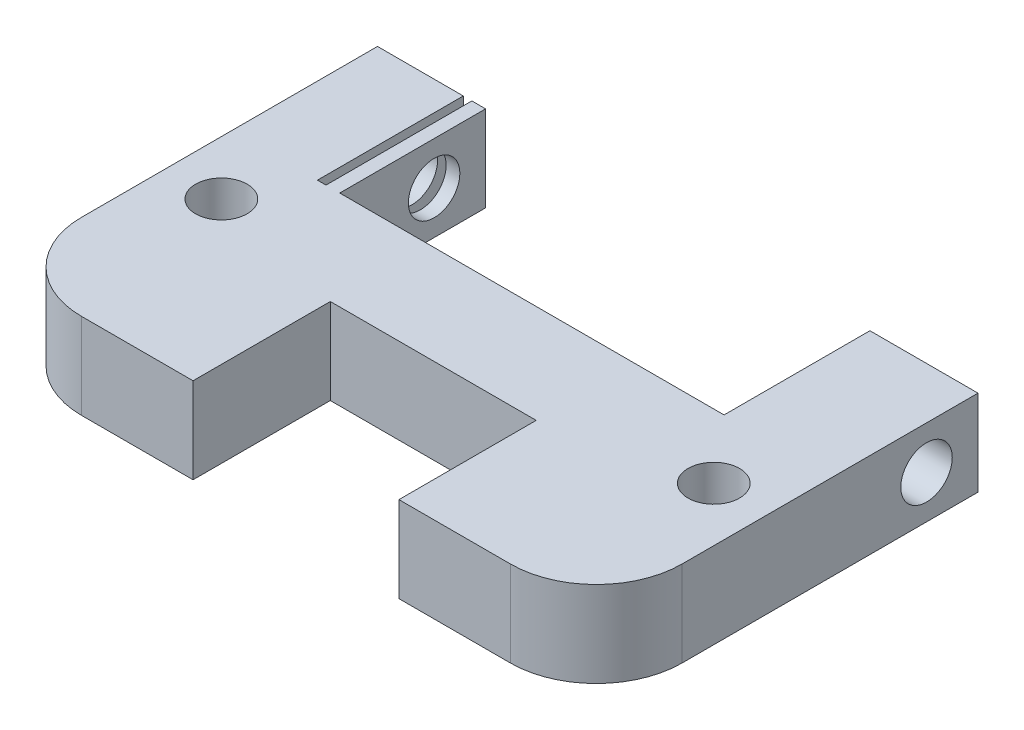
ISO-10303-21;
HEADER;
FILE_DESCRIPTION(('STEP AP214'),'2;1');
FILE_NAME('part.step','',(''),(''),'','','');
FILE_SCHEMA(('AUTOMOTIVE_DESIGN { 1 0 10303 214 1 1 1 1 }'));
ENDSEC;
DATA;
#1=APPLICATION_CONTEXT('core data for automotive mechanical design processes');
#2=APPLICATION_PROTOCOL_DEFINITION('international standard','automotive_design',2000,#1);
#3=PRODUCT_CONTEXT('',#1,'mechanical');
#4=PRODUCT('Part','Part','',(#3));
#5=PRODUCT_RELATED_PRODUCT_CATEGORY('part','',(#4));
#6=PRODUCT_DEFINITION_FORMATION('','',#4);
#7=PRODUCT_DEFINITION_CONTEXT('part definition',#1,'design');
#8=PRODUCT_DEFINITION('design','',#6,#7);
#9=PRODUCT_DEFINITION_SHAPE('','',#8);
#10=(LENGTH_UNIT() NAMED_UNIT(*) SI_UNIT(.MILLI.,.METRE.));
#11=(NAMED_UNIT(*) PLANE_ANGLE_UNIT() SI_UNIT($,.RADIAN.));
#12=(NAMED_UNIT(*) SI_UNIT($,.STERADIAN.) SOLID_ANGLE_UNIT());
#13=UNCERTAINTY_MEASURE_WITH_UNIT(LENGTH_MEASURE(1.E-05),#10,'distance_accuracy_value','');
#14=(GEOMETRIC_REPRESENTATION_CONTEXT(3) GLOBAL_UNCERTAINTY_ASSIGNED_CONTEXT((#13)) GLOBAL_UNIT_ASSIGNED_CONTEXT((#10,
#11,#12)) REPRESENTATION_CONTEXT('',''));
#15=CARTESIAN_POINT('',(0.,0.,0.));
#16=DIRECTION('',(0.,0.,1.));
#17=DIRECTION('',(1.,0.,0.));
#18=AXIS2_PLACEMENT_3D('',#15,#16,#17);
#19=CARTESIAN_POINT('',(0.,5.,0.));
#20=DIRECTION('',(0.,1.,0.));
#21=DIRECTION('',(0.,0.,1.));
#22=AXIS2_PLACEMENT_3D('',#19,#20,#21);
#23=PLANE('',#22);
#24=CARTESIAN_POINT('',(14.35,5.,12.25));
#25=DIRECTION('',(0.,1.,0.));
#26=DIRECTION('',(0.,0.,1.));
#27=AXIS2_PLACEMENT_3D('',#24,#25,#26);
#28=CIRCLE('',#27,1.5);
#29=CARTESIAN_POINT('',(14.35,5.,13.75));
#30=VERTEX_POINT('',#29);
#31=EDGE_CURVE('E211',#30,#30,#28,.T.);
#32=ORIENTED_EDGE('',*,*,#31,.F.);
#33=EDGE_LOOP('',(#32));
#34=FACE_BOUND('',#33,.T.);
#35=DIRECTION('',(1.,0.,0.));
#36=VECTOR('',#35,1.);
#37=CARTESIAN_POINT('',(6.00000000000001,5.,22.25));
#38=LINE('',#37,#36);
#39=CARTESIAN_POINT('',(6.00000000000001,5.,22.25));
#40=VERTEX_POINT('',#39);
#41=CARTESIAN_POINT('',(12.5,5.,22.25));
#42=VERTEX_POINT('',#41);
#43=EDGE_CURVE('E186',#40,#42,#38,.T.);
#44=ORIENTED_EDGE('',*,*,#43,.T.);
#45=CARTESIAN_POINT('',(12.5,5.,17.25));
#46=DIRECTION('',(0.,1.,0.));
#47=DIRECTION('',(0.,0.,1.));
#48=AXIS2_PLACEMENT_3D('',#45,#46,#47);
#49=CIRCLE('',#48,5.);
#50=CARTESIAN_POINT('',(17.5,5.,17.25));
#51=VERTEX_POINT('',#50);
#52=EDGE_CURVE('E292',#42,#51,#49,.T.);
#53=ORIENTED_EDGE('',*,*,#52,.T.);
#54=DIRECTION('',(0.,0.,-1.));
#55=VECTOR('',#54,1.);
#56=CARTESIAN_POINT('',(17.5,5.,0.));
#57=LINE('',#56,#55);
#58=CARTESIAN_POINT('',(17.5,5.,0.));
#59=VERTEX_POINT('',#58);
#60=EDGE_CURVE('E188',#51,#59,#57,.T.);
#61=ORIENTED_EDGE('',*,*,#60,.T.);
#62=DIRECTION('',(-1.,0.,0.));
#63=VECTOR('',#62,1.);
#64=CARTESIAN_POINT('',(11.2,5.,0.));
#65=LINE('',#64,#63);
#66=CARTESIAN_POINT('',(11.2,5.,0.));
#67=VERTEX_POINT('',#66);
#68=EDGE_CURVE('E190',#59,#67,#65,.T.);
#69=ORIENTED_EDGE('',*,*,#68,.T.);
#70=DIRECTION('',(0.,0.,1.));
#71=VECTOR('',#70,1.);
#72=CARTESIAN_POINT('',(11.2,5.,0.));
#73=LINE('',#72,#71);
#74=CARTESIAN_POINT('',(11.2,5.,8.5));
#75=VERTEX_POINT('',#74);
#76=EDGE_CURVE('E192',#67,#75,#73,.T.);
#77=ORIENTED_EDGE('',*,*,#76,.T.);
#78=DIRECTION('',(-1.,0.,0.));
#79=VECTOR('',#78,1.);
#80=CARTESIAN_POINT('',(-11.2,5.,8.50000000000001));
#81=LINE('',#80,#79);
#82=CARTESIAN_POINT('',(-11.2,5.,8.50000000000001));
#83=VERTEX_POINT('',#82);
#84=EDGE_CURVE('E194',#75,#83,#81,.T.);
#85=ORIENTED_EDGE('',*,*,#84,.T.);
#86=DIRECTION('',(0.,0.,-1.));
#87=VECTOR('',#86,1.);
#88=CARTESIAN_POINT('',(-11.2,5.,0.));
#89=LINE('',#88,#87);
#90=CARTESIAN_POINT('',(-11.2,5.,0.));
#91=VERTEX_POINT('',#90);
#92=EDGE_CURVE('E196',#83,#91,#89,.T.);
#93=ORIENTED_EDGE('',*,*,#92,.T.);
#94=DIRECTION('',(-1.,0.,0.));
#95=VECTOR('',#94,1.);
#96=CARTESIAN_POINT('',(-12.,5.,0.));
#97=LINE('',#96,#95);
#98=CARTESIAN_POINT('',(-12.,5.,0.));
#99=VERTEX_POINT('',#98);
#100=EDGE_CURVE('E198',#91,#99,#97,.T.);
#101=ORIENTED_EDGE('',*,*,#100,.T.);
#102=DIRECTION('',(0.,0.,1.));
#103=VECTOR('',#102,1.);
#104=CARTESIAN_POINT('',(-12.,5.,0.));
#105=LINE('',#104,#103);
#106=CARTESIAN_POINT('',(-12.,5.,8.50000000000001));
#107=VERTEX_POINT('',#106);
#108=EDGE_CURVE('E200',#99,#107,#105,.T.);
#109=ORIENTED_EDGE('',*,*,#108,.T.);
#110=DIRECTION('',(-1.,0.,0.));
#111=VECTOR('',#110,1.);
#112=CARTESIAN_POINT('',(-12.,5.,8.50000000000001));
#113=LINE('',#112,#111);
#114=CARTESIAN_POINT('',(-12.5,5.,8.50000000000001));
#115=VERTEX_POINT('',#114);
#116=EDGE_CURVE('E202',#107,#115,#113,.T.);
#117=ORIENTED_EDGE('',*,*,#116,.T.);
#118=DIRECTION('',(0.,0.,-1.));
#119=VECTOR('',#118,1.);
#120=CARTESIAN_POINT('',(-12.5,5.,8.50000000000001));
#121=LINE('',#120,#119);
#122=CARTESIAN_POINT('',(-12.5,5.,0.));
#123=VERTEX_POINT('',#122);
#124=EDGE_CURVE('E204',#115,#123,#121,.T.);
#125=ORIENTED_EDGE('',*,*,#124,.T.);
#126=DIRECTION('',(-1.,0.,0.));
#127=VECTOR('',#126,1.);
#128=CARTESIAN_POINT('',(-17.5,5.,0.));
#129=LINE('',#128,#127);
#130=CARTESIAN_POINT('',(-17.5,5.,0.));
#131=VERTEX_POINT('',#130);
#132=EDGE_CURVE('E206',#123,#131,#129,.T.);
#133=ORIENTED_EDGE('',*,*,#132,.T.);
#134=DIRECTION('',(0.,0.,1.));
#135=VECTOR('',#134,1.);
#136=CARTESIAN_POINT('',(-17.5,5.,0.));
#137=LINE('',#136,#135);
#138=CARTESIAN_POINT('',(-17.5,5.,17.25));
#139=VERTEX_POINT('',#138);
#140=EDGE_CURVE('E164',#131,#139,#137,.T.);
#141=ORIENTED_EDGE('',*,*,#140,.T.);
#142=CARTESIAN_POINT('',(-12.5,5.,17.25));
#143=DIRECTION('',(0.,1.,0.));
#144=DIRECTION('',(0.,0.,1.));
#145=AXIS2_PLACEMENT_3D('',#142,#143,#144);
#146=CIRCLE('',#145,5.);
#147=CARTESIAN_POINT('',(-12.5,5.,22.25));
#148=VERTEX_POINT('',#147);
#149=EDGE_CURVE('E47',#139,#148,#146,.T.);
#150=ORIENTED_EDGE('',*,*,#149,.T.);
#151=DIRECTION('',(1.,0.,0.));
#152=VECTOR('',#151,1.);
#153=CARTESIAN_POINT('',(-17.5,5.,22.25));
#154=LINE('',#153,#152);
#155=CARTESIAN_POINT('',(-5.99999999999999,5.,22.25));
#156=VERTEX_POINT('',#155);
#157=EDGE_CURVE('E154',#148,#156,#154,.T.);
#158=ORIENTED_EDGE('',*,*,#157,.T.);
#159=DIRECTION('',(0.,0.,-1.));
#160=VECTOR('',#159,1.);
#161=CARTESIAN_POINT('',(-5.99999999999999,5.,22.25));
#162=LINE('',#161,#160);
#163=CARTESIAN_POINT('',(-5.99999999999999,5.,14.25));
#164=VERTEX_POINT('',#163);
#165=EDGE_CURVE('E159',#156,#164,#162,.T.);
#166=ORIENTED_EDGE('',*,*,#165,.T.);
#167=DIRECTION('',(1.,0.,0.));
#168=VECTOR('',#167,1.);
#169=CARTESIAN_POINT('',(-5.99999999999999,5.,14.25));
#170=LINE('',#169,#168);
#171=CARTESIAN_POINT('',(6.00000000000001,5.,14.25));
#172=VERTEX_POINT('',#171);
#173=EDGE_CURVE('E179',#164,#172,#170,.T.);
#174=ORIENTED_EDGE('',*,*,#173,.T.);
#175=DIRECTION('',(0.,0.,1.));
#176=VECTOR('',#175,1.);
#177=CARTESIAN_POINT('',(6.00000000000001,5.,22.25));
#178=LINE('',#177,#176);
#179=EDGE_CURVE('E181',#172,#40,#178,.T.);
#180=ORIENTED_EDGE('',*,*,#179,.T.);
#181=EDGE_LOOP('',(#44,#53,#61,#69,#77,#85,#93,#101,#109,#117,#125,#133,#141,#150,#158,#166,
#174,#180));
#182=FACE_BOUND('',#181,.T.);
#183=CARTESIAN_POINT('',(-14.35,5.,12.25));
#184=DIRECTION('',(0.,1.,0.));
#185=DIRECTION('',(0.,0.,-1.));
#186=AXIS2_PLACEMENT_3D('',#183,#184,#185);
#187=CIRCLE('',#186,1.5);
#188=CARTESIAN_POINT('',(-14.35,5.,10.75));
#189=VERTEX_POINT('',#188);
#190=EDGE_CURVE('E371',#189,#189,#187,.T.);
#191=ORIENTED_EDGE('',*,*,#190,.F.);
#192=EDGE_LOOP('',(#191));
#193=FACE_BOUND('',#192,.T.);
#194=ADVANCED_FACE('F32',(#34,#182,#193),#23,.T.);
#195=CARTESIAN_POINT('',(0.,0.,0.));
#196=DIRECTION('',(0.,1.,0.));
#197=DIRECTION('',(0.,0.,1.));
#198=AXIS2_PLACEMENT_3D('',#195,#196,#197);
#199=PLANE('',#198);
#200=CARTESIAN_POINT('',(14.35,0.,12.25));
#201=DIRECTION('',(0.,1.,0.));
#202=DIRECTION('',(0.,0.,1.));
#203=AXIS2_PLACEMENT_3D('',#200,#201,#202);
#204=CIRCLE('',#203,1.5);
#205=CARTESIAN_POINT('',(14.35,0.,13.75));
#206=VERTEX_POINT('',#205);
#207=EDGE_CURVE('E368',#206,#206,#204,.T.);
#208=ORIENTED_EDGE('',*,*,#207,.T.);
#209=EDGE_LOOP('',(#208));
#210=FACE_BOUND('',#209,.T.);
#211=DIRECTION('',(0.,0.,-1.));
#212=VECTOR('',#211,1.);
#213=CARTESIAN_POINT('',(17.5,0.,0.));
#214=LINE('',#213,#212);
#215=CARTESIAN_POINT('',(17.5,0.,17.25));
#216=VERTEX_POINT('',#215);
#217=CARTESIAN_POINT('',(17.5,0.,0.));
#218=VERTEX_POINT('',#217);
#219=EDGE_CURVE('E222',#216,#218,#214,.T.);
#220=ORIENTED_EDGE('',*,*,#219,.F.);
#221=CARTESIAN_POINT('',(12.5,0.,17.25));
#222=DIRECTION('',(0.,1.,0.));
#223=DIRECTION('',(0.,0.,1.));
#224=AXIS2_PLACEMENT_3D('',#221,#222,#223);
#225=CIRCLE('',#224,5.);
#226=CARTESIAN_POINT('',(12.5,0.,22.25));
#227=VERTEX_POINT('',#226);
#228=EDGE_CURVE('E287',#216,#227,#225,.F.);
#229=ORIENTED_EDGE('',*,*,#228,.T.);
#230=DIRECTION('',(1.,0.,0.));
#231=VECTOR('',#230,1.);
#232=CARTESIAN_POINT('',(6.00000000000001,0.,22.25));
#233=LINE('',#232,#231);
#234=CARTESIAN_POINT('',(6.00000000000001,0.,22.25));
#235=VERTEX_POINT('',#234);
#236=EDGE_CURVE('E219',#235,#227,#233,.T.);
#237=ORIENTED_EDGE('',*,*,#236,.F.);
#238=DIRECTION('',(0.,0.,1.));
#239=VECTOR('',#238,1.);
#240=CARTESIAN_POINT('',(6.00000000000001,0.,22.25));
#241=LINE('',#240,#239);
#242=CARTESIAN_POINT('',(6.00000000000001,0.,14.25));
#243=VERTEX_POINT('',#242);
#244=EDGE_CURVE('E217',#243,#235,#241,.T.);
#245=ORIENTED_EDGE('',*,*,#244,.F.);
#246=DIRECTION('',(1.,0.,0.));
#247=VECTOR('',#246,1.);
#248=CARTESIAN_POINT('',(-5.99999999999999,0.,14.25));
#249=LINE('',#248,#247);
#250=CARTESIAN_POINT('',(-5.99999999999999,0.,14.25));
#251=VERTEX_POINT('',#250);
#252=EDGE_CURVE('E215',#251,#243,#249,.T.);
#253=ORIENTED_EDGE('',*,*,#252,.F.);
#254=DIRECTION('',(0.,0.,-1.));
#255=VECTOR('',#254,1.);
#256=CARTESIAN_POINT('',(-5.99999999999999,0.,22.25));
#257=LINE('',#256,#255);
#258=CARTESIAN_POINT('',(-5.99999999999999,0.,22.25));
#259=VERTEX_POINT('',#258);
#260=EDGE_CURVE('E213',#259,#251,#257,.T.);
#261=ORIENTED_EDGE('',*,*,#260,.F.);
#262=DIRECTION('',(1.,0.,0.));
#263=VECTOR('',#262,1.);
#264=CARTESIAN_POINT('',(-17.5,0.,22.25));
#265=LINE('',#264,#263);
#266=CARTESIAN_POINT('',(-12.5,0.,22.25));
#267=VERTEX_POINT('',#266);
#268=EDGE_CURVE('E170',#267,#259,#265,.T.);
#269=ORIENTED_EDGE('',*,*,#268,.F.);
#270=CARTESIAN_POINT('',(-12.5,0.,17.25));
#271=DIRECTION('',(0.,1.,0.));
#272=DIRECTION('',(0.,0.,1.));
#273=AXIS2_PLACEMENT_3D('',#270,#271,#272);
#274=CIRCLE('',#273,5.);
#275=CARTESIAN_POINT('',(-17.5,0.,17.25));
#276=VERTEX_POINT('',#275);
#277=EDGE_CURVE('E285',#267,#276,#274,.F.);
#278=ORIENTED_EDGE('',*,*,#277,.T.);
#279=DIRECTION('',(0.,0.,1.));
#280=VECTOR('',#279,1.);
#281=CARTESIAN_POINT('',(-17.5,0.,0.));
#282=LINE('',#281,#280);
#283=CARTESIAN_POINT('',(-17.5,0.,0.));
#284=VERTEX_POINT('',#283);
#285=EDGE_CURVE('E209',#284,#276,#282,.T.);
#286=ORIENTED_EDGE('',*,*,#285,.F.);
#287=DIRECTION('',(-1.,0.,0.));
#288=VECTOR('',#287,1.);
#289=CARTESIAN_POINT('',(-17.5,0.,0.));
#290=LINE('',#289,#288);
#291=CARTESIAN_POINT('',(-12.5,0.,0.));
#292=VERTEX_POINT('',#291);
#293=EDGE_CURVE('E240',#292,#284,#290,.T.);
#294=ORIENTED_EDGE('',*,*,#293,.F.);
#295=DIRECTION('',(0.,0.,-1.));
#296=VECTOR('',#295,1.);
#297=CARTESIAN_POINT('',(-12.5,0.,8.50000000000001));
#298=LINE('',#297,#296);
#299=CARTESIAN_POINT('',(-12.5,0.,8.50000000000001));
#300=VERTEX_POINT('',#299);
#301=EDGE_CURVE('E238',#300,#292,#298,.T.);
#302=ORIENTED_EDGE('',*,*,#301,.F.);
#303=DIRECTION('',(-1.,0.,0.));
#304=VECTOR('',#303,1.);
#305=CARTESIAN_POINT('',(-12.,0.,8.50000000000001));
#306=LINE('',#305,#304);
#307=CARTESIAN_POINT('',(-12.,0.,8.50000000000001));
#308=VERTEX_POINT('',#307);
#309=EDGE_CURVE('E236',#308,#300,#306,.T.);
#310=ORIENTED_EDGE('',*,*,#309,.F.);
#311=DIRECTION('',(0.,0.,1.));
#312=VECTOR('',#311,1.);
#313=CARTESIAN_POINT('',(-12.,0.,0.));
#314=LINE('',#313,#312);
#315=CARTESIAN_POINT('',(-12.,0.,0.));
#316=VERTEX_POINT('',#315);
#317=EDGE_CURVE('E234',#316,#308,#314,.T.);
#318=ORIENTED_EDGE('',*,*,#317,.F.);
#319=DIRECTION('',(-1.,0.,0.));
#320=VECTOR('',#319,1.);
#321=CARTESIAN_POINT('',(-12.,0.,0.));
#322=LINE('',#321,#320);
#323=CARTESIAN_POINT('',(-11.2,0.,0.));
#324=VERTEX_POINT('',#323);
#325=EDGE_CURVE('E232',#324,#316,#322,.T.);
#326=ORIENTED_EDGE('',*,*,#325,.F.);
#327=DIRECTION('',(0.,0.,-1.));
#328=VECTOR('',#327,1.);
#329=CARTESIAN_POINT('',(-11.2,0.,0.));
#330=LINE('',#329,#328);
#331=CARTESIAN_POINT('',(-11.2,0.,8.50000000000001));
#332=VERTEX_POINT('',#331);
#333=EDGE_CURVE('E230',#332,#324,#330,.T.);
#334=ORIENTED_EDGE('',*,*,#333,.F.);
#335=DIRECTION('',(-1.,0.,0.));
#336=VECTOR('',#335,1.);
#337=CARTESIAN_POINT('',(-11.2,0.,8.50000000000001));
#338=LINE('',#337,#336);
#339=CARTESIAN_POINT('',(11.2,0.,8.5));
#340=VERTEX_POINT('',#339);
#341=EDGE_CURVE('E228',#340,#332,#338,.T.);
#342=ORIENTED_EDGE('',*,*,#341,.F.);
#343=DIRECTION('',(0.,0.,1.));
#344=VECTOR('',#343,1.);
#345=CARTESIAN_POINT('',(11.2,0.,0.));
#346=LINE('',#345,#344);
#347=CARTESIAN_POINT('',(11.2,0.,0.));
#348=VERTEX_POINT('',#347);
#349=EDGE_CURVE('E226',#348,#340,#346,.T.);
#350=ORIENTED_EDGE('',*,*,#349,.F.);
#351=DIRECTION('',(-1.,0.,0.));
#352=VECTOR('',#351,1.);
#353=CARTESIAN_POINT('',(11.2,0.,0.));
#354=LINE('',#353,#352);
#355=EDGE_CURVE('E224',#218,#348,#354,.T.);
#356=ORIENTED_EDGE('',*,*,#355,.F.);
#357=EDGE_LOOP('',(#220,#229,#237,#245,#253,#261,#269,#278,#286,#294,#302,#310,#318,#326,#334,
#342,#350,#356));
#358=FACE_BOUND('',#357,.T.);
#359=CARTESIAN_POINT('',(-14.35,0.,12.25));
#360=DIRECTION('',(0.,1.,0.));
#361=DIRECTION('',(0.,0.,-1.));
#362=AXIS2_PLACEMENT_3D('',#359,#360,#361);
#363=CIRCLE('',#362,1.5);
#364=CARTESIAN_POINT('',(-14.35,0.,10.75));
#365=VERTEX_POINT('',#364);
#366=EDGE_CURVE('E374',#365,#365,#363,.T.);
#367=ORIENTED_EDGE('',*,*,#366,.T.);
#368=EDGE_LOOP('',(#367));
#369=FACE_BOUND('',#368,.T.);
#370=ADVANCED_FACE('F296',(#210,#358,#369),#199,.F.);
#371=CARTESIAN_POINT('',(-17.5,5.,0.));
#372=DIRECTION('',(1.,0.,0.));
#373=DIRECTION('',(0.,0.,-1.));
#374=AXIS2_PLACEMENT_3D('',#371,#372,#373);
#375=PLANE('',#374);
#376=CARTESIAN_POINT('',(-17.5,2.5,3.));
#377=DIRECTION('',(1.,0.,0.));
#378=DIRECTION('',(0.,0.,-1.));
#379=AXIS2_PLACEMENT_3D('',#376,#377,#378);
#380=CIRCLE('',#379,1.5);
#381=CARTESIAN_POINT('',(-17.5,2.5,1.5));
#382=VERTEX_POINT('',#381);
#383=EDGE_CURVE('E282',#382,#382,#380,.T.);
#384=ORIENTED_EDGE('',*,*,#383,.T.);
#385=EDGE_LOOP('',(#384));
#386=FACE_BOUND('',#385,.T.);
#387=ORIENTED_EDGE('',*,*,#285,.T.);
#388=DIRECTION('',(0.,-1.,0.));
#389=VECTOR('',#388,1.);
#390=CARTESIAN_POINT('',(-17.5,5.,17.25));
#391=LINE('',#390,#389);
#392=EDGE_CURVE('E11',#276,#139,#391,.F.);
#393=ORIENTED_EDGE('',*,*,#392,.T.);
#394=ORIENTED_EDGE('',*,*,#140,.F.);
#395=DIRECTION('',(0.,-1.,0.));
#396=VECTOR('',#395,1.);
#397=CARTESIAN_POINT('',(-17.5,5.,0.));
#398=LINE('',#397,#396);
#399=EDGE_CURVE('E208',#131,#284,#398,.T.);
#400=ORIENTED_EDGE('',*,*,#399,.T.);
#401=EDGE_LOOP('',(#387,#393,#394,#400));
#402=FACE_BOUND('',#401,.T.);
#403=ADVANCED_FACE('F366',(#386,#402),#375,.F.);
#404=CARTESIAN_POINT('',(-17.5,5.,22.25));
#405=DIRECTION('',(0.,0.,-1.));
#406=DIRECTION('',(-1.,0.,0.));
#407=AXIS2_PLACEMENT_3D('',#404,#405,#406);
#408=PLANE('',#407);
#409=ORIENTED_EDGE('',*,*,#157,.F.);
#410=DIRECTION('',(0.,-1.,0.));
#411=VECTOR('',#410,1.);
#412=CARTESIAN_POINT('',(-12.5,5.,22.25));
#413=LINE('',#412,#411);
#414=EDGE_CURVE('E40',#148,#267,#413,.T.);
#415=ORIENTED_EDGE('',*,*,#414,.T.);
#416=ORIENTED_EDGE('',*,*,#268,.T.);
#417=DIRECTION('',(0.,-1.,0.));
#418=VECTOR('',#417,1.);
#419=CARTESIAN_POINT('',(-5.99999999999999,5.,22.25));
#420=LINE('',#419,#418);
#421=EDGE_CURVE('E167',#156,#259,#420,.T.);
#422=ORIENTED_EDGE('',*,*,#421,.F.);
#423=EDGE_LOOP('',(#409,#415,#416,#422));
#424=FACE_BOUND('',#423,.T.);
#425=ADVANCED_FACE('F168',(#424),#408,.F.);
#426=CARTESIAN_POINT('',(-5.99999999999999,5.,22.25));
#427=DIRECTION('',(-1.,0.,0.));
#428=DIRECTION('',(0.,0.,1.));
#429=AXIS2_PLACEMENT_3D('',#426,#427,#428);
#430=PLANE('',#429);
#431=ORIENTED_EDGE('',*,*,#260,.T.);
#432=DIRECTION('',(0.,-1.,0.));
#433=VECTOR('',#432,1.);
#434=CARTESIAN_POINT('',(-5.99999999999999,5.,14.25));
#435=LINE('',#434,#433);
#436=EDGE_CURVE('E174',#164,#251,#435,.T.);
#437=ORIENTED_EDGE('',*,*,#436,.F.);
#438=ORIENTED_EDGE('',*,*,#165,.F.);
#439=ORIENTED_EDGE('',*,*,#421,.T.);
#440=EDGE_LOOP('',(#431,#437,#438,#439));
#441=FACE_BOUND('',#440,.T.);
#442=ADVANCED_FACE('F176',(#441),#430,.F.);
#443=CARTESIAN_POINT('',(-5.99999999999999,5.,14.25));
#444=DIRECTION('',(0.,0.,-1.));
#445=DIRECTION('',(-1.,0.,0.));
#446=AXIS2_PLACEMENT_3D('',#443,#444,#445);
#447=PLANE('',#446);
#448=ORIENTED_EDGE('',*,*,#252,.T.);
#449=DIRECTION('',(0.,-1.,0.));
#450=VECTOR('',#449,1.);
#451=CARTESIAN_POINT('',(6.00000000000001,5.,14.25));
#452=LINE('',#451,#450);
#453=EDGE_CURVE('E274',#172,#243,#452,.T.);
#454=ORIENTED_EDGE('',*,*,#453,.F.);
#455=ORIENTED_EDGE('',*,*,#173,.F.);
#456=ORIENTED_EDGE('',*,*,#436,.T.);
#457=EDGE_LOOP('',(#448,#454,#455,#456));
#458=FACE_BOUND('',#457,.T.);
#459=ADVANCED_FACE('F302',(#458),#447,.F.);
#460=CARTESIAN_POINT('',(6.00000000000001,5.,22.25));
#461=DIRECTION('',(1.,0.,0.));
#462=DIRECTION('',(0.,0.,-1.));
#463=AXIS2_PLACEMENT_3D('',#460,#461,#462);
#464=PLANE('',#463);
#465=ORIENTED_EDGE('',*,*,#244,.T.);
#466=DIRECTION('',(0.,-1.,0.));
#467=VECTOR('',#466,1.);
#468=CARTESIAN_POINT('',(6.00000000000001,5.,22.25));
#469=LINE('',#468,#467);
#470=EDGE_CURVE('E271',#40,#235,#469,.T.);
#471=ORIENTED_EDGE('',*,*,#470,.F.);
#472=ORIENTED_EDGE('',*,*,#179,.F.);
#473=ORIENTED_EDGE('',*,*,#453,.T.);
#474=EDGE_LOOP('',(#465,#471,#472,#473));
#475=FACE_BOUND('',#474,.T.);
#476=ADVANCED_FACE('F309',(#475),#464,.F.);
#477=CARTESIAN_POINT('',(6.00000000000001,5.,22.25));
#478=DIRECTION('',(0.,0.,-1.));
#479=DIRECTION('',(-1.,0.,0.));
#480=AXIS2_PLACEMENT_3D('',#477,#478,#479);
#481=PLANE('',#480);
#482=ORIENTED_EDGE('',*,*,#236,.T.);
#483=DIRECTION('',(0.,-1.,0.));
#484=VECTOR('',#483,1.);
#485=CARTESIAN_POINT('',(12.5,5.,22.25));
#486=LINE('',#485,#484);
#487=EDGE_CURVE('E289',#227,#42,#486,.F.);
#488=ORIENTED_EDGE('',*,*,#487,.T.);
#489=ORIENTED_EDGE('',*,*,#43,.F.);
#490=ORIENTED_EDGE('',*,*,#470,.T.);
#491=EDGE_LOOP('',(#482,#488,#489,#490));
#492=FACE_BOUND('',#491,.T.);
#493=ADVANCED_FACE('F312',(#492),#481,.F.);
#494=CARTESIAN_POINT('',(17.5,5.,0.));
#495=DIRECTION('',(-1.,0.,0.));
#496=DIRECTION('',(0.,0.,1.));
#497=AXIS2_PLACEMENT_3D('',#494,#495,#496);
#498=PLANE('',#497);
#499=CARTESIAN_POINT('',(17.5,2.5,3.));
#500=DIRECTION('',(1.,0.,0.));
#501=DIRECTION('',(0.,0.,-1.));
#502=AXIS2_PLACEMENT_3D('',#499,#500,#501);
#503=CIRCLE('',#502,1.5);
#504=CARTESIAN_POINT('',(17.5,2.5,1.5));
#505=VERTEX_POINT('',#504);
#506=EDGE_CURVE('E387',#505,#505,#503,.T.);
#507=ORIENTED_EDGE('',*,*,#506,.F.);
#508=EDGE_LOOP('',(#507));
#509=FACE_BOUND('',#508,.T.);
#510=ORIENTED_EDGE('',*,*,#60,.F.);
#511=DIRECTION('',(0.,-1.,0.));
#512=VECTOR('',#511,1.);
#513=CARTESIAN_POINT('',(17.5,5.,17.25));
#514=LINE('',#513,#512);
#515=EDGE_CURVE('E173',#51,#216,#514,.T.);
#516=ORIENTED_EDGE('',*,*,#515,.T.);
#517=ORIENTED_EDGE('',*,*,#219,.T.);
#518=DIRECTION('',(0.,-1.,0.));
#519=VECTOR('',#518,1.);
#520=CARTESIAN_POINT('',(17.5,5.,0.));
#521=LINE('',#520,#519);
#522=EDGE_CURVE('E268',#59,#218,#521,.T.);
#523=ORIENTED_EDGE('',*,*,#522,.F.);
#524=EDGE_LOOP('',(#510,#516,#517,#523));
#525=FACE_BOUND('',#524,.T.);
#526=ADVANCED_FACE('F320',(#509,#525),#498,.F.);
#527=CARTESIAN_POINT('',(11.2,5.,0.));
#528=DIRECTION('',(0.,0.,1.));
#529=DIRECTION('',(1.,0.,0.));
#530=AXIS2_PLACEMENT_3D('',#527,#528,#529);
#531=PLANE('',#530);
#532=ORIENTED_EDGE('',*,*,#355,.T.);
#533=DIRECTION('',(0.,-1.,0.));
#534=VECTOR('',#533,1.);
#535=CARTESIAN_POINT('',(11.2,5.,0.));
#536=LINE('',#535,#534);
#537=EDGE_CURVE('E265',#67,#348,#536,.T.);
#538=ORIENTED_EDGE('',*,*,#537,.F.);
#539=ORIENTED_EDGE('',*,*,#68,.F.);
#540=ORIENTED_EDGE('',*,*,#522,.T.);
#541=EDGE_LOOP('',(#532,#538,#539,#540));
#542=FACE_BOUND('',#541,.T.);
#543=ADVANCED_FACE('F325',(#542),#531,.F.);
#544=CARTESIAN_POINT('',(11.2,5.,0.));
#545=DIRECTION('',(1.,0.,0.));
#546=DIRECTION('',(0.,0.,-1.));
#547=AXIS2_PLACEMENT_3D('',#544,#545,#546);
#548=PLANE('',#547);
#549=CARTESIAN_POINT('',(11.2,2.5,3.));
#550=DIRECTION('',(1.,0.,0.));
#551=DIRECTION('',(0.,0.,-1.));
#552=AXIS2_PLACEMENT_3D('',#549,#550,#551);
#553=CIRCLE('',#552,1.5);
#554=CARTESIAN_POINT('',(11.2,2.5,1.5));
#555=VERTEX_POINT('',#554);
#556=EDGE_CURVE('E377',#555,#555,#553,.T.);
#557=ORIENTED_EDGE('',*,*,#556,.T.);
#558=EDGE_LOOP('',(#557));
#559=FACE_BOUND('',#558,.T.);
#560=ORIENTED_EDGE('',*,*,#349,.T.);
#561=DIRECTION('',(0.,-1.,0.));
#562=VECTOR('',#561,1.);
#563=CARTESIAN_POINT('',(11.2,5.,8.5));
#564=LINE('',#563,#562);
#565=EDGE_CURVE('E262',#75,#340,#564,.T.);
#566=ORIENTED_EDGE('',*,*,#565,.F.);
#567=ORIENTED_EDGE('',*,*,#76,.F.);
#568=ORIENTED_EDGE('',*,*,#537,.T.);
#569=EDGE_LOOP('',(#560,#566,#567,#568));
#570=FACE_BOUND('',#569,.T.);
#571=ADVANCED_FACE('F331',(#559,#570),#548,.F.);
#572=CARTESIAN_POINT('',(-11.2,5.,8.50000000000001));
#573=DIRECTION('',(0.,0.,1.));
#574=DIRECTION('',(1.,0.,0.));
#575=AXIS2_PLACEMENT_3D('',#572,#573,#574);
#576=PLANE('',#575);
#577=ORIENTED_EDGE('',*,*,#341,.T.);
#578=DIRECTION('',(0.,-1.,0.));
#579=VECTOR('',#578,1.);
#580=CARTESIAN_POINT('',(-11.2,5.,8.50000000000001));
#581=LINE('',#580,#579);
#582=EDGE_CURVE('E259',#83,#332,#581,.T.);
#583=ORIENTED_EDGE('',*,*,#582,.F.);
#584=ORIENTED_EDGE('',*,*,#84,.F.);
#585=ORIENTED_EDGE('',*,*,#565,.T.);
#586=EDGE_LOOP('',(#577,#583,#584,#585));
#587=FACE_BOUND('',#586,.T.);
#588=ADVANCED_FACE('F335',(#587),#576,.F.);
#589=CARTESIAN_POINT('',(-11.2,5.,0.));
#590=DIRECTION('',(-1.,0.,0.));
#591=DIRECTION('',(0.,0.,1.));
#592=AXIS2_PLACEMENT_3D('',#589,#590,#591);
#593=PLANE('',#592);
#594=CARTESIAN_POINT('',(-11.2,2.5,3.));
#595=DIRECTION('',(-1.,0.,0.));
#596=DIRECTION('',(0.,0.,1.));
#597=AXIS2_PLACEMENT_3D('',#594,#595,#596);
#598=CIRCLE('',#597,1.5);
#599=CARTESIAN_POINT('',(-11.2,2.5,4.5));
#600=VERTEX_POINT('',#599);
#601=EDGE_CURVE('E382',#600,#600,#598,.T.);
#602=ORIENTED_EDGE('',*,*,#601,.T.);
#603=EDGE_LOOP('',(#602));
#604=FACE_BOUND('',#603,.T.);
#605=ORIENTED_EDGE('',*,*,#333,.T.);
#606=DIRECTION('',(0.,-1.,0.));
#607=VECTOR('',#606,1.);
#608=CARTESIAN_POINT('',(-11.2,5.,0.));
#609=LINE('',#608,#607);
#610=EDGE_CURVE('E256',#91,#324,#609,.T.);
#611=ORIENTED_EDGE('',*,*,#610,.F.);
#612=ORIENTED_EDGE('',*,*,#92,.F.);
#613=ORIENTED_EDGE('',*,*,#582,.T.);
#614=EDGE_LOOP('',(#605,#611,#612,#613));
#615=FACE_BOUND('',#614,.T.);
#616=ADVANCED_FACE('F340',(#604,#615),#593,.F.);
#617=CARTESIAN_POINT('',(-12.,5.,0.));
#618=DIRECTION('',(0.,0.,1.));
#619=DIRECTION('',(1.,0.,0.));
#620=AXIS2_PLACEMENT_3D('',#617,#618,#619);
#621=PLANE('',#620);
#622=ORIENTED_EDGE('',*,*,#325,.T.);
#623=DIRECTION('',(0.,-1.,0.));
#624=VECTOR('',#623,1.);
#625=CARTESIAN_POINT('',(-12.,5.,0.));
#626=LINE('',#625,#624);
#627=EDGE_CURVE('E253',#99,#316,#626,.T.);
#628=ORIENTED_EDGE('',*,*,#627,.F.);
#629=ORIENTED_EDGE('',*,*,#100,.F.);
#630=ORIENTED_EDGE('',*,*,#610,.T.);
#631=EDGE_LOOP('',(#622,#628,#629,#630));
#632=FACE_BOUND('',#631,.T.);
#633=ADVANCED_FACE('F346',(#632),#621,.F.);
#634=CARTESIAN_POINT('',(-12.,5.,0.));
#635=DIRECTION('',(1.,0.,0.));
#636=DIRECTION('',(0.,0.,-1.));
#637=AXIS2_PLACEMENT_3D('',#634,#635,#636);
#638=PLANE('',#637);
#639=CARTESIAN_POINT('',(-12.,2.5,3.));
#640=DIRECTION('',(1.,0.,0.));
#641=DIRECTION('',(0.,0.,-1.));
#642=AXIS2_PLACEMENT_3D('',#639,#640,#641);
#643=CIRCLE('',#642,1.5);
#644=CARTESIAN_POINT('',(-12.,2.5,1.5));
#645=VERTEX_POINT('',#644);
#646=EDGE_CURVE('E281',#645,#645,#643,.T.);
#647=ORIENTED_EDGE('',*,*,#646,.T.);
#648=EDGE_LOOP('',(#647));
#649=FACE_BOUND('',#648,.T.);
#650=ORIENTED_EDGE('',*,*,#317,.T.);
#651=DIRECTION('',(0.,-1.,0.));
#652=VECTOR('',#651,1.);
#653=CARTESIAN_POINT('',(-12.,5.,8.50000000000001));
#654=LINE('',#653,#652);
#655=EDGE_CURVE('E250',#107,#308,#654,.T.);
#656=ORIENTED_EDGE('',*,*,#655,.F.);
#657=ORIENTED_EDGE('',*,*,#108,.F.);
#658=ORIENTED_EDGE('',*,*,#627,.T.);
#659=EDGE_LOOP('',(#650,#656,#657,#658));
#660=FACE_BOUND('',#659,.T.);
#661=ADVANCED_FACE('F350',(#649,#660),#638,.F.);
#662=CARTESIAN_POINT('',(-12.,5.,8.50000000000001));
#663=DIRECTION('',(0.,0.,1.));
#664=DIRECTION('',(1.,0.,0.));
#665=AXIS2_PLACEMENT_3D('',#662,#663,#664);
#666=PLANE('',#665);
#667=ORIENTED_EDGE('',*,*,#309,.T.);
#668=DIRECTION('',(0.,-1.,0.));
#669=VECTOR('',#668,1.);
#670=CARTESIAN_POINT('',(-12.5,5.,8.50000000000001));
#671=LINE('',#670,#669);
#672=EDGE_CURVE('E247',#115,#300,#671,.T.);
#673=ORIENTED_EDGE('',*,*,#672,.F.);
#674=ORIENTED_EDGE('',*,*,#116,.F.);
#675=ORIENTED_EDGE('',*,*,#655,.T.);
#676=EDGE_LOOP('',(#667,#673,#674,#675));
#677=FACE_BOUND('',#676,.T.);
#678=ADVANCED_FACE('F355',(#677),#666,.F.);
#679=CARTESIAN_POINT('',(-12.5,5.,8.50000000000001));
#680=DIRECTION('',(-1.,0.,0.));
#681=DIRECTION('',(0.,0.,1.));
#682=AXIS2_PLACEMENT_3D('',#679,#680,#681);
#683=PLANE('',#682);
#684=CARTESIAN_POINT('',(-12.5,2.5,3.));
#685=DIRECTION('',(-1.,0.,0.));
#686=DIRECTION('',(0.,0.,1.));
#687=AXIS2_PLACEMENT_3D('',#684,#685,#686);
#688=CIRCLE('',#687,1.5);
#689=CARTESIAN_POINT('',(-12.5,2.5,4.5));
#690=VERTEX_POINT('',#689);
#691=EDGE_CURVE('E278',#690,#690,#688,.T.);
#692=ORIENTED_EDGE('',*,*,#691,.T.);
#693=EDGE_LOOP('',(#692));
#694=FACE_BOUND('',#693,.T.);
#695=ORIENTED_EDGE('',*,*,#301,.T.);
#696=DIRECTION('',(0.,-1.,0.));
#697=VECTOR('',#696,1.);
#698=CARTESIAN_POINT('',(-12.5,5.,0.));
#699=LINE('',#698,#697);
#700=EDGE_CURVE('E244',#123,#292,#699,.T.);
#701=ORIENTED_EDGE('',*,*,#700,.F.);
#702=ORIENTED_EDGE('',*,*,#124,.F.);
#703=ORIENTED_EDGE('',*,*,#672,.T.);
#704=EDGE_LOOP('',(#695,#701,#702,#703));
#705=FACE_BOUND('',#704,.T.);
#706=ADVANCED_FACE('F361',(#694,#705),#683,.F.);
#707=CARTESIAN_POINT('',(-17.5,5.,0.));
#708=DIRECTION('',(0.,0.,1.));
#709=DIRECTION('',(1.,0.,0.));
#710=AXIS2_PLACEMENT_3D('',#707,#708,#709);
#711=PLANE('',#710);
#712=ORIENTED_EDGE('',*,*,#293,.T.);
#713=ORIENTED_EDGE('',*,*,#399,.F.);
#714=ORIENTED_EDGE('',*,*,#132,.F.);
#715=ORIENTED_EDGE('',*,*,#700,.T.);
#716=EDGE_LOOP('',(#712,#713,#714,#715));
#717=FACE_BOUND('',#716,.T.);
#718=ADVANCED_FACE('F365',(#717),#711,.F.);
#719=CARTESIAN_POINT('',(14.35,5.,12.25));
#720=DIRECTION('',(0.,-1.,0.));
#721=DIRECTION('',(0.,0.,-1.));
#722=AXIS2_PLACEMENT_3D('',#719,#720,#721);
#723=CYLINDRICAL_SURFACE('',#722,1.5);
#724=ORIENTED_EDGE('',*,*,#31,.T.);
#725=EDGE_LOOP('',(#724));
#726=FACE_BOUND('',#725,.T.);
#727=ORIENTED_EDGE('',*,*,#207,.F.);
#728=EDGE_LOOP('',(#727));
#729=FACE_BOUND('',#728,.T.);
#730=ADVANCED_FACE('F409',(#726,#729),#723,.F.);
#731=CARTESIAN_POINT('',(-14.35,5.,12.25));
#732=DIRECTION('',(0.,-1.,0.));
#733=DIRECTION('',(0.,0.,-1.));
#734=AXIS2_PLACEMENT_3D('',#731,#732,#733);
#735=CYLINDRICAL_SURFACE('',#734,1.5);
#736=ORIENTED_EDGE('',*,*,#190,.T.);
#737=EDGE_LOOP('',(#736));
#738=FACE_BOUND('',#737,.T.);
#739=ORIENTED_EDGE('',*,*,#366,.F.);
#740=EDGE_LOOP('',(#739));
#741=FACE_BOUND('',#740,.T.);
#742=ADVANCED_FACE('F398',(#738,#741),#735,.F.);
#743=CARTESIAN_POINT('',(-17.5,2.5,3.));
#744=DIRECTION('',(1.,0.,0.));
#745=DIRECTION('',(0.,0.,-1.));
#746=AXIS2_PLACEMENT_3D('',#743,#744,#745);
#747=CYLINDRICAL_SURFACE('',#746,1.5);
#748=ORIENTED_EDGE('',*,*,#383,.F.);
#749=EDGE_LOOP('',(#748));
#750=FACE_BOUND('',#749,.T.);
#751=ORIENTED_EDGE('',*,*,#691,.F.);
#752=EDGE_LOOP('',(#751));
#753=FACE_BOUND('',#752,.T.);
#754=ADVANCED_FACE('F394',(#750,#753),#747,.F.);
#755=ORIENTED_EDGE('',*,*,#646,.F.);
#756=EDGE_LOOP('',(#755));
#757=FACE_BOUND('',#756,.T.);
#758=ORIENTED_EDGE('',*,*,#601,.F.);
#759=EDGE_LOOP('',(#758));
#760=FACE_BOUND('',#759,.T.);
#761=ADVANCED_FACE('F397',(#757,#760),#747,.F.);
#762=ORIENTED_EDGE('',*,*,#506,.T.);
#763=EDGE_LOOP('',(#762));
#764=FACE_BOUND('',#763,.T.);
#765=ORIENTED_EDGE('',*,*,#556,.F.);
#766=EDGE_LOOP('',(#765));
#767=FACE_BOUND('',#766,.T.);
#768=ADVANCED_FACE('F400',(#764,#767),#747,.F.);
#769=CARTESIAN_POINT('',(12.5,5.,17.25));
#770=DIRECTION('',(0.,-1.,0.));
#771=DIRECTION('',(0.,0.,-1.));
#772=AXIS2_PLACEMENT_3D('',#769,#770,#771);
#773=CYLINDRICAL_SURFACE('',#772,5.);
#774=ORIENTED_EDGE('',*,*,#52,.F.);
#775=ORIENTED_EDGE('',*,*,#487,.F.);
#776=ORIENTED_EDGE('',*,*,#228,.F.);
#777=ORIENTED_EDGE('',*,*,#515,.F.);
#778=EDGE_LOOP('',(#774,#775,#776,#777));
#779=FACE_BOUND('',#778,.T.);
#780=ADVANCED_FACE('F315',(#779),#773,.T.);
#781=CARTESIAN_POINT('',(-12.5,5.,17.25));
#782=DIRECTION('',(0.,-1.,0.));
#783=DIRECTION('',(0.,0.,-1.));
#784=AXIS2_PLACEMENT_3D('',#781,#782,#783);
#785=CYLINDRICAL_SURFACE('',#784,5.);
#786=ORIENTED_EDGE('',*,*,#149,.F.);
#787=ORIENTED_EDGE('',*,*,#392,.F.);
#788=ORIENTED_EDGE('',*,*,#277,.F.);
#789=ORIENTED_EDGE('',*,*,#414,.F.);
#790=EDGE_LOOP('',(#786,#787,#788,#789));
#791=FACE_BOUND('',#790,.T.);
#792=ADVANCED_FACE('F34',(#791),#785,.T.);
#793=CLOSED_SHELL('',(#194,#370,#403,#425,#442,#459,#476,#493,#526,#543,#571,#588,#616,#633,
#661,#678,#706,#718,#730,#742,#754,#761,#768,#780,#792));
#794=MANIFOLD_SOLID_BREP('B2',#793);
#795=ADVANCED_BREP_SHAPE_REPRESENTATION('',(#18,#794),#14);
#796=SHAPE_DEFINITION_REPRESENTATION(#9,#795);
ENDSEC;
END-ISO-10303-21;
